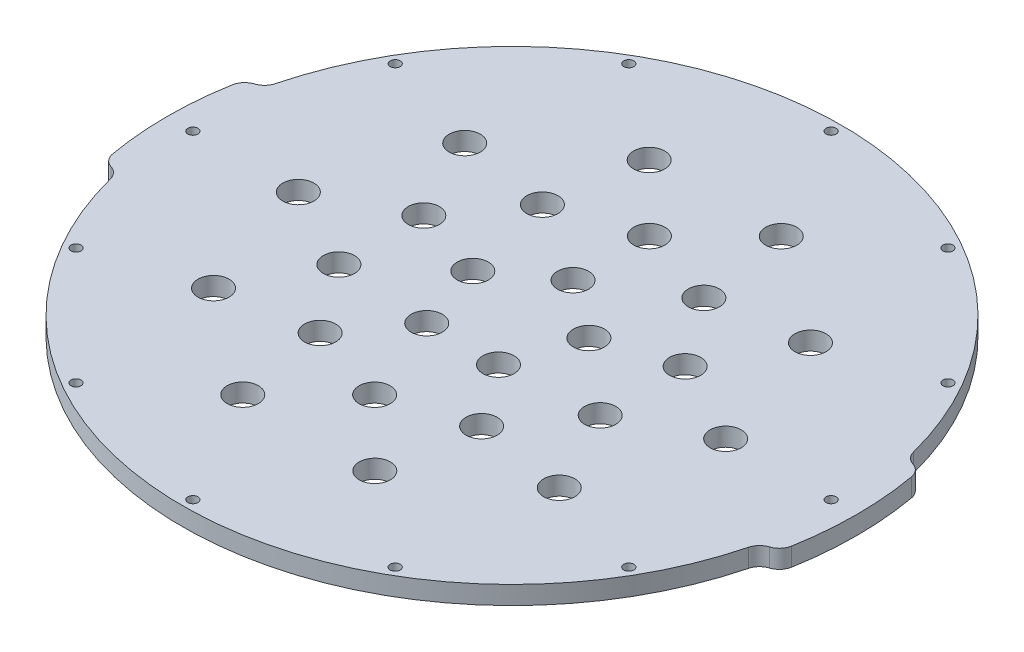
from build123d import *

# Parameters (mm, degrees)
SKETCH1_R           = 1.65
BOSS_EXTRUDE1_DEPTH = 6
FILLET1_R           = 5
SKETCH2_R           = 5.1
CUT_EXTRUDE1_DEPTH  = 157.355060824


with BuildPart() as part:
    # Sketch1 → Boss-Extrude1 (new body)
    with BuildSketch(Plane(origin=(0, 0, 0), x_dir=(1, 0, 0), z_dir=(0, 1, 0))):
        with BuildLine():
            ThreePointArc((-111.234035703, -19.613561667), (-112.95, 0), (-111.234035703, 19.613561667))
            ThreePointArc((-111.234035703, 19.613561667), (-109.13025705, 22.87401705), (-105.327953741, 23.647931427))
            ThreePointArc((-105.327953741, 23.647931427), (0, 107.95), (105.327953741, 23.647931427))
            ThreePointArc((105.327953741, 23.647931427), (109.13025705, 22.87401705), (111.234035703, 19.613561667))
            ThreePointArc((111.234035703, 19.613561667), (112.95, 0), (111.234035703, -19.613561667))
            ThreePointArc((111.234035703, -19.613561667), (109.13025705, -22.87401705), (105.327953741, -23.647931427))
            ThreePointArc((105.327953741, -23.647931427), (0, -107.95), (-105.327953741, -23.647931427))
            ThreePointArc((-105.327953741, -23.647931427), (-109.13025705, -22.87401705), (-111.234035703, -19.613561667))
        make_face()
        with Locations(Location((0, 104.55, 0), (0, 0, 270))):
            Circle(SKETCH1_R, mode=Mode.SUBTRACT)
        with Locations(Location((52.275, 90.542955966, 0), (0, 0, 270))):
            Circle(SKETCH1_R, mode=Mode.SUBTRACT)
        with Locations(Location((90.542955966, 52.275, 0), (0, 0, 270))):
            Circle(SKETCH1_R, mode=Mode.SUBTRACT)
        with Locations(Location((104.55, 0, 0), (0, 0, 270))):
            Circle(SKETCH1_R, mode=Mode.SUBTRACT)
        with Locations(Location((90.542955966, -52.275, 0), (0, 0, 270))):
            Circle(SKETCH1_R, mode=Mode.SUBTRACT)
        with Locations(Location((52.275, -90.542955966, 0), (0, 0, 270))):
            Circle(SKETCH1_R, mode=Mode.SUBTRACT)
        with Locations(Location((0, -104.55, 0), (0, 0, 270))):
            Circle(SKETCH1_R, mode=Mode.SUBTRACT)
        with Locations(Location((-52.275, -90.542955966, 0), (0, 0, 270))):
            Circle(SKETCH1_R, mode=Mode.SUBTRACT)
        with Locations(Location((-90.542955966, -52.275, 0), (0, 0, 270))):
            Circle(SKETCH1_R, mode=Mode.SUBTRACT)
        with Locations(Location((-104.55, 0, 0), (0, 0, 270))):
            Circle(SKETCH1_R, mode=Mode.SUBTRACT)
        with Locations(Location((-90.542955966, 52.275, 0), (0, 0, 270))):
            Circle(SKETCH1_R, mode=Mode.SUBTRACT)
        with Locations(Location((-52.275, 90.542955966, 0), (0, 0, 270))):
            Circle(SKETCH1_R, mode=Mode.SUBTRACT)
    extrude(amount=BOSS_EXTRUDE1_DEPTH)

    # Fillet1
    fillet1_edges = [part.edges().sort_by_distance(p)[0] for p in [
        (-105.327953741, 3, -23.647931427),
        (105.327953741, 3, -23.647931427),
        (105.327953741, 3, 23.647931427),
        (-105.327953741, 3, 23.647931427),
    ]]
    fillet(fillet1_edges, radius=FILLET1_R)

    # Sketch2 → Cut-Extrude1 (cut, through all)
    with BuildSketch(Plane(origin=(0, 6, 0), x_dir=(1, 0, 0), z_dir=(0, 1, 0))):
        with Locations(Location((0, 45, 0), (0, 0, 270))):
            Circle(SKETCH2_R)
        with Locations(Location((26.450336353, 36.405764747, 0), (0, 0, 270))):
            Circle(SKETCH2_R)
        with Locations(Location((42.797543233, 13.905764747, 0), (0, 0, 270))):
            Circle(SKETCH2_R)
        with Locations(Location((42.797543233, -13.905764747, 0), (0, 0, 270))):
            Circle(SKETCH2_R)
        with Locations(Location((26.450336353, -36.405764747, 0), (0, 0, 270))):
            Circle(SKETCH2_R)
        with Locations(Location((0, -45, 0), (0, 0, 270))):
            Circle(SKETCH2_R)
        with Locations(Location((-26.450336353, -36.405764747, 0), (0, 0, 270))):
            Circle(SKETCH2_R)
        with Locations(Location((-42.797543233, -13.905764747, 0), (0, 0, 270))):
            Circle(SKETCH2_R)
        with Locations(Location((-42.797543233, 13.905764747, 0), (0, 0, 270))):
            Circle(SKETCH2_R)
        with Locations(Location((-26.450336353, 36.405764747, 0), (0, 0, 270))):
            Circle(SKETCH2_R)
        with Locations(Location((11.755705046, -16.180339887, 0), (0, 0, 270))):
            Circle(SKETCH2_R)
        with Locations(Location((-11.755705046, -16.180339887, 0), (0, 0, 270))):
            Circle(SKETCH2_R)
        with Locations(Location((-19.021130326, 6.180339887, 0), (0, 0, 270))):
            Circle(SKETCH2_R)
        with Locations(Location((0, 20, 0), (0, 0, 270))):
            Circle(SKETCH2_R)
        with Locations(Location((19.021130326, 6.180339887, 0), (0, 0, 270))):
            Circle(SKETCH2_R)
        with Locations(Location((21.631189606, -66.573956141, 0), (0, 0, 270))):
            Circle(SKETCH2_R)
        with Locations(Location((-21.631189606, -66.573956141, 0), (0, 0, 270))):
            Circle(SKETCH2_R)
        with Locations(Location((-56.631189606, -41.14496766, 0), (0, 0, 270))):
            Circle(SKETCH2_R)
        with Locations(Location((-70, 0, 0), (0, 0, 270))):
            Circle(SKETCH2_R)
        with Locations(Location((-56.631189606, 41.14496766, 0), (0, 0, 270))):
            Circle(SKETCH2_R)
        with Locations(Location((-21.631189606, 66.573956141, 0), (0, 0, 270))):
            Circle(SKETCH2_R)
        with Locations(Location((21.631189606, 66.573956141, 0), (0, 0, 270))):
            Circle(SKETCH2_R)
        with Locations(Location((56.631189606, 41.14496766, 0), (0, 0, 270))):
            Circle(SKETCH2_R)
        with Locations(Location((70, 0, 0), (0, 0, 270))):
            Circle(SKETCH2_R)
        with Locations(Location((56.631189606, -41.14496766, 0), (0, 0, 270))):
            Circle(SKETCH2_R)
    extrude(amount=-CUT_EXTRUDE1_DEPTH, mode=Mode.SUBTRACT)


solid = part.part
